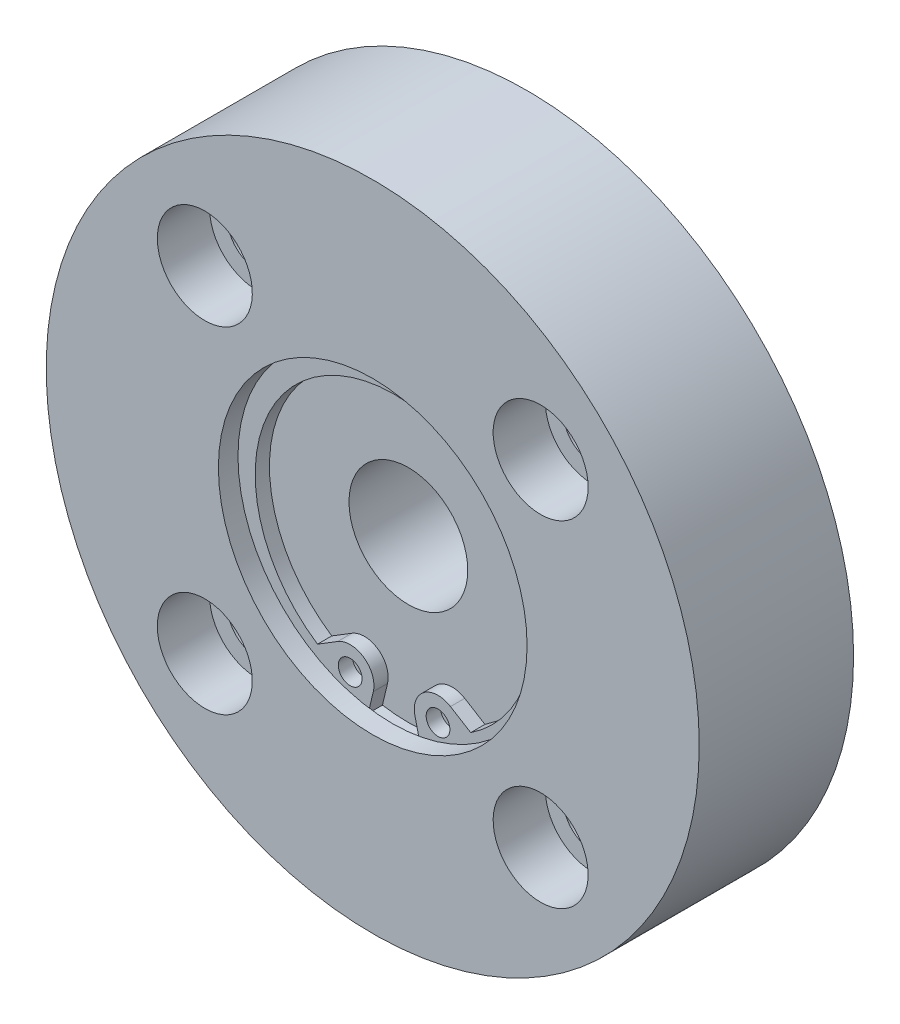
ISO-10303-21;
HEADER;
FILE_DESCRIPTION(('STEP AP214'),'2;1');
FILE_NAME('part.step','',(''),(''),'','','');
FILE_SCHEMA(('AUTOMOTIVE_DESIGN { 1 0 10303 214 1 1 1 1 }'));
ENDSEC;
DATA;
#1=APPLICATION_CONTEXT('core data for automotive mechanical design processes');
#2=APPLICATION_PROTOCOL_DEFINITION('international standard','automotive_design',2000,#1);
#3=PRODUCT_CONTEXT('',#1,'mechanical');
#4=PRODUCT('Part','Part','',(#3));
#5=PRODUCT_RELATED_PRODUCT_CATEGORY('part','',(#4));
#6=PRODUCT_DEFINITION_FORMATION('','',#4);
#7=PRODUCT_DEFINITION_CONTEXT('part definition',#1,'design');
#8=PRODUCT_DEFINITION('design','',#6,#7);
#9=PRODUCT_DEFINITION_SHAPE('','',#8);
#10=(LENGTH_UNIT() NAMED_UNIT(*) SI_UNIT(.MILLI.,.METRE.));
#11=(NAMED_UNIT(*) PLANE_ANGLE_UNIT() SI_UNIT($,.RADIAN.));
#12=(NAMED_UNIT(*) SI_UNIT($,.STERADIAN.) SOLID_ANGLE_UNIT());
#13=UNCERTAINTY_MEASURE_WITH_UNIT(LENGTH_MEASURE(1.E-05),#10,'distance_accuracy_value','');
#14=(GEOMETRIC_REPRESENTATION_CONTEXT(3) GLOBAL_UNCERTAINTY_ASSIGNED_CONTEXT((#13)) GLOBAL_UNIT_ASSIGNED_CONTEXT((#10,
#11,#12)) REPRESENTATION_CONTEXT('',''));
#15=CARTESIAN_POINT('',(0.,0.,0.));
#16=DIRECTION('',(0.,0.,1.));
#17=DIRECTION('',(1.,0.,0.));
#18=AXIS2_PLACEMENT_3D('',#15,#16,#17);
#19=CARTESIAN_POINT('',(0.,0.,10.));
#20=DIRECTION('',(0.,0.,1.));
#21=DIRECTION('',(1.,0.,0.));
#22=AXIS2_PLACEMENT_3D('',#19,#20,#21);
#23=PLANE('',#22);
#24=CARTESIAN_POINT('',(3.7,-11.165302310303,10.));
#25=DIRECTION('',(0.,0.,1.));
#26=DIRECTION('',(1.,0.,0.));
#27=AXIS2_PLACEMENT_3D('',#24,#25,#26);
#28=CIRCLE('',#27,1.);
#29=CARTESIAN_POINT('',(4.7,-11.165302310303,10.));
#30=VERTEX_POINT('',#29);
#31=EDGE_CURVE('E116',#30,#30,#28,.T.);
#32=ORIENTED_EDGE('',*,*,#31,.T.);
#33=EDGE_LOOP('',(#32));
#34=FACE_BOUND('',#33,.T.);
#35=ADVANCED_FACE('F14',(#34),#23,.T.);
#36=CARTESIAN_POINT('',(-3.7,-11.165302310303,10.));
#37=DIRECTION('',(0.,0.,-1.));
#38=DIRECTION('',(1.,0.,0.));
#39=AXIS2_PLACEMENT_3D('',#36,#37,#38);
#40=CIRCLE('',#39,1.);
#41=CARTESIAN_POINT('',(-2.7,-11.165302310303,10.));
#42=VERTEX_POINT('',#41);
#43=EDGE_CURVE('E141',#42,#42,#40,.T.);
#44=ORIENTED_EDGE('',*,*,#43,.F.);
#45=EDGE_LOOP('',(#44));
#46=FACE_BOUND('',#45,.T.);
#47=ADVANCED_FACE('F274',(#46),#23,.T.);
#48=CARTESIAN_POINT('',(14.1421356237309,14.142135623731,8.6));
#49=DIRECTION('',(0.,0.,1.));
#50=DIRECTION('',(1.,0.,0.));
#51=AXIS2_PLACEMENT_3D('',#48,#49,#50);
#52=PLANE('',#51);
#53=CARTESIAN_POINT('',(14.1421356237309,14.142135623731,8.6));
#54=DIRECTION('',(0.,0.,1.));
#55=DIRECTION('',(1.,0.,0.));
#56=AXIS2_PLACEMENT_3D('',#53,#54,#55);
#57=CIRCLE('',#56,4.);
#58=CARTESIAN_POINT('',(18.1421356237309,14.142135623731,8.6));
#59=VERTEX_POINT('',#58);
#60=EDGE_CURVE('E225',#59,#59,#57,.T.);
#61=ORIENTED_EDGE('',*,*,#60,.T.);
#62=EDGE_LOOP('',(#61));
#63=FACE_BOUND('',#62,.T.);
#64=CARTESIAN_POINT('',(14.1421356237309,14.142135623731,8.6));
#65=DIRECTION('',(0.,0.,1.));
#66=DIRECTION('',(1.,0.,0.));
#67=AXIS2_PLACEMENT_3D('',#64,#65,#66);
#68=CIRCLE('',#67,2.5);
#69=CARTESIAN_POINT('',(16.6421356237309,14.142135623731,8.6));
#70=VERTEX_POINT('',#69);
#71=EDGE_CURVE('E228',#70,#70,#68,.F.);
#72=ORIENTED_EDGE('',*,*,#71,.T.);
#73=EDGE_LOOP('',(#72));
#74=FACE_BOUND('',#73,.T.);
#75=ADVANCED_FACE('F280',(#63,#74),#52,.T.);
#76=CARTESIAN_POINT('',(14.142135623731,-14.1421356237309,8.6));
#77=DIRECTION('',(0.,0.,1.));
#78=DIRECTION('',(1.,0.,0.));
#79=AXIS2_PLACEMENT_3D('',#76,#77,#78);
#80=PLANE('',#79);
#81=CARTESIAN_POINT('',(14.142135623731,-14.1421356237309,8.6));
#82=DIRECTION('',(0.,0.,1.));
#83=DIRECTION('',(0.,-1.,0.));
#84=AXIS2_PLACEMENT_3D('',#81,#82,#83);
#85=CIRCLE('',#84,4.);
#86=CARTESIAN_POINT('',(14.142135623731,-18.1421356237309,8.6));
#87=VERTEX_POINT('',#86);
#88=EDGE_CURVE('E209',#87,#87,#85,.T.);
#89=ORIENTED_EDGE('',*,*,#88,.T.);
#90=EDGE_LOOP('',(#89));
#91=FACE_BOUND('',#90,.T.);
#92=CARTESIAN_POINT('',(14.142135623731,-14.1421356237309,8.6));
#93=DIRECTION('',(0.,0.,1.));
#94=DIRECTION('',(1.,0.,0.));
#95=AXIS2_PLACEMENT_3D('',#92,#93,#94);
#96=CIRCLE('',#95,2.5);
#97=CARTESIAN_POINT('',(16.642135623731,-14.1421356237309,8.6));
#98=VERTEX_POINT('',#97);
#99=EDGE_CURVE('E212',#98,#98,#96,.F.);
#100=ORIENTED_EDGE('',*,*,#99,.T.);
#101=EDGE_LOOP('',(#100));
#102=FACE_BOUND('',#101,.T.);
#103=ADVANCED_FACE('F556',(#91,#102),#80,.T.);
#104=CARTESIAN_POINT('',(-14.142135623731,-14.1421356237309,8.6));
#105=DIRECTION('',(0.,0.,1.));
#106=DIRECTION('',(1.,0.,0.));
#107=AXIS2_PLACEMENT_3D('',#104,#105,#106);
#108=PLANE('',#107);
#109=CARTESIAN_POINT('',(-14.142135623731,-14.1421356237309,8.6));
#110=DIRECTION('',(0.,0.,1.));
#111=DIRECTION('',(-1.,0.,0.));
#112=AXIS2_PLACEMENT_3D('',#109,#110,#111);
#113=CIRCLE('',#112,4.);
#114=CARTESIAN_POINT('',(-18.142135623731,-14.1421356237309,8.6));
#115=VERTEX_POINT('',#114);
#116=EDGE_CURVE('E202',#115,#115,#113,.T.);
#117=ORIENTED_EDGE('',*,*,#116,.T.);
#118=EDGE_LOOP('',(#117));
#119=FACE_BOUND('',#118,.T.);
#120=CARTESIAN_POINT('',(-14.142135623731,-14.1421356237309,8.6));
#121=DIRECTION('',(0.,0.,1.));
#122=DIRECTION('',(1.,0.,0.));
#123=AXIS2_PLACEMENT_3D('',#120,#121,#122);
#124=CIRCLE('',#123,2.5);
#125=CARTESIAN_POINT('',(-11.642135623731,-14.1421356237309,8.6));
#126=VERTEX_POINT('',#125);
#127=EDGE_CURVE('E205',#126,#126,#124,.F.);
#128=ORIENTED_EDGE('',*,*,#127,.T.);
#129=EDGE_LOOP('',(#128));
#130=FACE_BOUND('',#129,.T.);
#131=ADVANCED_FACE('F547',(#119,#130),#108,.T.);
#132=CARTESIAN_POINT('',(-14.1421356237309,14.142135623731,8.6));
#133=DIRECTION('',(0.,0.,1.));
#134=DIRECTION('',(1.,0.,0.));
#135=AXIS2_PLACEMENT_3D('',#132,#133,#134);
#136=PLANE('',#135);
#137=CARTESIAN_POINT('',(-14.1421356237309,14.142135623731,8.6));
#138=DIRECTION('',(0.,0.,1.));
#139=DIRECTION('',(0.,1.,0.));
#140=AXIS2_PLACEMENT_3D('',#137,#138,#139);
#141=CIRCLE('',#140,4.);
#142=CARTESIAN_POINT('',(-14.1421356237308,18.142135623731,8.6));
#143=VERTEX_POINT('',#142);
#144=EDGE_CURVE('E195',#143,#143,#141,.T.);
#145=ORIENTED_EDGE('',*,*,#144,.T.);
#146=EDGE_LOOP('',(#145));
#147=FACE_BOUND('',#146,.T.);
#148=CARTESIAN_POINT('',(-14.1421356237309,14.142135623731,8.6));
#149=DIRECTION('',(0.,0.,1.));
#150=DIRECTION('',(1.,0.,0.));
#151=AXIS2_PLACEMENT_3D('',#148,#149,#150);
#152=CIRCLE('',#151,2.5);
#153=CARTESIAN_POINT('',(-11.6421356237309,14.142135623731,8.6));
#154=VERTEX_POINT('',#153);
#155=EDGE_CURVE('E198',#154,#154,#152,.F.);
#156=ORIENTED_EDGE('',*,*,#155,.T.);
#157=EDGE_LOOP('',(#156));
#158=FACE_BOUND('',#157,.T.);
#159=ADVANCED_FACE('F538',(#147,#158),#136,.T.);
#160=CARTESIAN_POINT('',(14.1421356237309,14.142135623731,0.));
#161=DIRECTION('',(0.,0.,1.));
#162=DIRECTION('',(1.,0.,0.));
#163=AXIS2_PLACEMENT_3D('',#160,#161,#162);
#164=CYLINDRICAL_SURFACE('',#163,2.5);
#165=CARTESIAN_POINT('',(14.1421356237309,14.142135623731,0.));
#166=DIRECTION('',(0.,0.,1.));
#167=DIRECTION('',(1.,0.,0.));
#168=AXIS2_PLACEMENT_3D('',#165,#166,#167);
#169=CIRCLE('',#168,2.5);
#170=CARTESIAN_POINT('',(16.6421356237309,14.142135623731,0.));
#171=VERTEX_POINT('',#170);
#172=EDGE_CURVE('E229',#171,#171,#169,.T.);
#173=ORIENTED_EDGE('',*,*,#172,.F.);
#174=EDGE_LOOP('',(#173));
#175=FACE_BOUND('',#174,.T.);
#176=ORIENTED_EDGE('',*,*,#71,.F.);
#177=EDGE_LOOP('',(#176));
#178=FACE_BOUND('',#177,.T.);
#179=ADVANCED_FACE('F529',(#175,#178),#164,.F.);
#180=CARTESIAN_POINT('',(14.142135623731,-14.1421356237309,0.));
#181=DIRECTION('',(0.,0.,1.));
#182=DIRECTION('',(1.,0.,0.));
#183=AXIS2_PLACEMENT_3D('',#180,#181,#182);
#184=CYLINDRICAL_SURFACE('',#183,2.5);
#185=CARTESIAN_POINT('',(14.142135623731,-14.1421356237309,0.));
#186=DIRECTION('',(0.,0.,1.));
#187=DIRECTION('',(0.,-1.,0.));
#188=AXIS2_PLACEMENT_3D('',#185,#186,#187);
#189=CIRCLE('',#188,2.5);
#190=CARTESIAN_POINT('',(14.142135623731,-16.6421356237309,0.));
#191=VERTEX_POINT('',#190);
#192=EDGE_CURVE('E219',#191,#191,#189,.T.);
#193=ORIENTED_EDGE('',*,*,#192,.F.);
#194=EDGE_LOOP('',(#193));
#195=FACE_BOUND('',#194,.T.);
#196=ORIENTED_EDGE('',*,*,#99,.F.);
#197=EDGE_LOOP('',(#196));
#198=FACE_BOUND('',#197,.T.);
#199=ADVANCED_FACE('F520',(#195,#198),#184,.F.);
#200=CARTESIAN_POINT('',(-14.142135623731,-14.1421356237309,0.));
#201=DIRECTION('',(0.,0.,1.));
#202=DIRECTION('',(1.,0.,0.));
#203=AXIS2_PLACEMENT_3D('',#200,#201,#202);
#204=CYLINDRICAL_SURFACE('',#203,2.5);
#205=CARTESIAN_POINT('',(-14.142135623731,-14.1421356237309,0.));
#206=DIRECTION('',(0.,0.,1.));
#207=DIRECTION('',(-1.,0.,0.));
#208=AXIS2_PLACEMENT_3D('',#205,#206,#207);
#209=CIRCLE('',#208,2.5);
#210=CARTESIAN_POINT('',(-16.642135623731,-14.1421356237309,0.));
#211=VERTEX_POINT('',#210);
#212=EDGE_CURVE('E216',#211,#211,#209,.T.);
#213=ORIENTED_EDGE('',*,*,#212,.F.);
#214=EDGE_LOOP('',(#213));
#215=FACE_BOUND('',#214,.T.);
#216=ORIENTED_EDGE('',*,*,#127,.F.);
#217=EDGE_LOOP('',(#216));
#218=FACE_BOUND('',#217,.T.);
#219=ADVANCED_FACE('F511',(#215,#218),#204,.F.);
#220=CARTESIAN_POINT('',(-14.1421356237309,14.142135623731,0.));
#221=DIRECTION('',(0.,0.,1.));
#222=DIRECTION('',(1.,0.,0.));
#223=AXIS2_PLACEMENT_3D('',#220,#221,#222);
#224=CYLINDRICAL_SURFACE('',#223,2.5);
#225=CARTESIAN_POINT('',(-14.1421356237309,14.142135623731,0.));
#226=DIRECTION('',(0.,0.,1.));
#227=DIRECTION('',(0.,1.,0.));
#228=AXIS2_PLACEMENT_3D('',#225,#226,#227);
#229=CIRCLE('',#228,2.5);
#230=CARTESIAN_POINT('',(-14.1421356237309,16.642135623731,0.));
#231=VERTEX_POINT('',#230);
#232=EDGE_CURVE('E213',#231,#231,#229,.T.);
#233=ORIENTED_EDGE('',*,*,#232,.F.);
#234=EDGE_LOOP('',(#233));
#235=FACE_BOUND('',#234,.T.);
#236=ORIENTED_EDGE('',*,*,#155,.F.);
#237=EDGE_LOOP('',(#236));
#238=FACE_BOUND('',#237,.T.);
#239=ADVANCED_FACE('F503',(#235,#238),#224,.F.);
#240=CARTESIAN_POINT('',(0.,0.,13.));
#241=DIRECTION('',(0.,0.,-1.));
#242=DIRECTION('',(-1.,0.,0.));
#243=AXIS2_PLACEMENT_3D('',#240,#241,#242);
#244=CYLINDRICAL_SURFACE('',#243,27.5);
#245=CARTESIAN_POINT('',(0.,0.,13.));
#246=DIRECTION('',(0.,0.,1.));
#247=DIRECTION('',(1.,0.,0.));
#248=AXIS2_PLACEMENT_3D('',#245,#246,#247);
#249=CIRCLE('',#248,27.5);
#250=CARTESIAN_POINT('',(27.5,0.,13.));
#251=VERTEX_POINT('',#250);
#252=EDGE_CURVE('E142',#251,#251,#249,.T.);
#253=ORIENTED_EDGE('',*,*,#252,.F.);
#254=EDGE_LOOP('',(#253));
#255=FACE_BOUND('',#254,.T.);
#256=CARTESIAN_POINT('',(0.,0.,0.));
#257=DIRECTION('',(0.,0.,1.));
#258=DIRECTION('',(1.,0.,0.));
#259=AXIS2_PLACEMENT_3D('',#256,#257,#258);
#260=CIRCLE('',#259,27.5);
#261=CARTESIAN_POINT('',(27.5,0.,0.));
#262=VERTEX_POINT('',#261);
#263=EDGE_CURVE('E232',#262,#262,#260,.T.);
#264=ORIENTED_EDGE('',*,*,#263,.T.);
#265=EDGE_LOOP('',(#264));
#266=FACE_BOUND('',#265,.T.);
#267=ADVANCED_FACE('F16',(#255,#266),#244,.T.);
#268=CARTESIAN_POINT('',(14.1421356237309,14.142135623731,8.6));
#269=DIRECTION('',(0.,0.,1.));
#270=DIRECTION('',(1.,0.,0.));
#271=AXIS2_PLACEMENT_3D('',#268,#269,#270);
#272=CYLINDRICAL_SURFACE('',#271,4.);
#273=ORIENTED_EDGE('',*,*,#60,.F.);
#274=EDGE_LOOP('',(#273));
#275=FACE_BOUND('',#274,.T.);
#276=CARTESIAN_POINT('',(14.1421356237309,14.142135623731,13.));
#277=DIRECTION('',(0.,0.,1.));
#278=DIRECTION('',(1.,0.,0.));
#279=AXIS2_PLACEMENT_3D('',#276,#277,#278);
#280=CIRCLE('',#279,4.);
#281=CARTESIAN_POINT('',(18.1421356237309,14.142135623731,13.));
#282=VERTEX_POINT('',#281);
#283=EDGE_CURVE('E222',#282,#282,#280,.T.);
#284=ORIENTED_EDGE('',*,*,#283,.T.);
#285=EDGE_LOOP('',(#284));
#286=FACE_BOUND('',#285,.T.);
#287=ADVANCED_FACE('F486',(#275,#286),#272,.F.);
#288=CARTESIAN_POINT('',(14.142135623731,-14.1421356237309,8.6));
#289=DIRECTION('',(0.,0.,1.));
#290=DIRECTION('',(1.,0.,0.));
#291=AXIS2_PLACEMENT_3D('',#288,#289,#290);
#292=CYLINDRICAL_SURFACE('',#291,4.);
#293=ORIENTED_EDGE('',*,*,#88,.F.);
#294=EDGE_LOOP('',(#293));
#295=FACE_BOUND('',#294,.T.);
#296=CARTESIAN_POINT('',(14.142135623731,-14.1421356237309,13.));
#297=DIRECTION('',(0.,0.,1.));
#298=DIRECTION('',(0.,-1.,0.));
#299=AXIS2_PLACEMENT_3D('',#296,#297,#298);
#300=CIRCLE('',#299,4.);
#301=CARTESIAN_POINT('',(14.142135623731,-18.1421356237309,13.));
#302=VERTEX_POINT('',#301);
#303=EDGE_CURVE('E206',#302,#302,#300,.T.);
#304=ORIENTED_EDGE('',*,*,#303,.T.);
#305=EDGE_LOOP('',(#304));
#306=FACE_BOUND('',#305,.T.);
#307=ADVANCED_FACE('F477',(#295,#306),#292,.F.);
#308=CARTESIAN_POINT('',(-14.142135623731,-14.1421356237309,8.6));
#309=DIRECTION('',(0.,0.,1.));
#310=DIRECTION('',(1.,0.,0.));
#311=AXIS2_PLACEMENT_3D('',#308,#309,#310);
#312=CYLINDRICAL_SURFACE('',#311,4.);
#313=ORIENTED_EDGE('',*,*,#116,.F.);
#314=EDGE_LOOP('',(#313));
#315=FACE_BOUND('',#314,.T.);
#316=CARTESIAN_POINT('',(-14.142135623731,-14.1421356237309,13.));
#317=DIRECTION('',(0.,0.,1.));
#318=DIRECTION('',(-1.,0.,0.));
#319=AXIS2_PLACEMENT_3D('',#316,#317,#318);
#320=CIRCLE('',#319,4.);
#321=CARTESIAN_POINT('',(-18.142135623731,-14.1421356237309,13.));
#322=VERTEX_POINT('',#321);
#323=EDGE_CURVE('E199',#322,#322,#320,.T.);
#324=ORIENTED_EDGE('',*,*,#323,.T.);
#325=EDGE_LOOP('',(#324));
#326=FACE_BOUND('',#325,.T.);
#327=ADVANCED_FACE('F468',(#315,#326),#312,.F.);
#328=CARTESIAN_POINT('',(-14.1421356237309,14.142135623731,8.6));
#329=DIRECTION('',(0.,0.,1.));
#330=DIRECTION('',(1.,0.,0.));
#331=AXIS2_PLACEMENT_3D('',#328,#329,#330);
#332=CYLINDRICAL_SURFACE('',#331,4.);
#333=ORIENTED_EDGE('',*,*,#144,.F.);
#334=EDGE_LOOP('',(#333));
#335=FACE_BOUND('',#334,.T.);
#336=CARTESIAN_POINT('',(-14.1421356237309,14.142135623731,13.));
#337=DIRECTION('',(0.,0.,1.));
#338=DIRECTION('',(0.,1.,0.));
#339=AXIS2_PLACEMENT_3D('',#336,#337,#338);
#340=CIRCLE('',#339,4.);
#341=CARTESIAN_POINT('',(-14.1421356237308,18.142135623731,13.));
#342=VERTEX_POINT('',#341);
#343=EDGE_CURVE('E192',#342,#342,#340,.T.);
#344=ORIENTED_EDGE('',*,*,#343,.T.);
#345=EDGE_LOOP('',(#344));
#346=FACE_BOUND('',#345,.T.);
#347=ADVANCED_FACE('F459',(#335,#346),#332,.F.);
#348=CARTESIAN_POINT('',(0.,0.,0.));
#349=DIRECTION('',(0.,0.,1.));
#350=DIRECTION('',(1.,0.,0.));
#351=AXIS2_PLACEMENT_3D('',#348,#349,#350);
#352=PLANE('',#351);
#353=CARTESIAN_POINT('',(0.,0.,0.));
#354=DIRECTION('',(0.,0.,-1.));
#355=DIRECTION('',(-1.,0.,0.));
#356=AXIS2_PLACEMENT_3D('',#353,#354,#355);
#357=CIRCLE('',#356,11.);
#358=CARTESIAN_POINT('',(-11.,0.,0.));
#359=VERTEX_POINT('',#358);
#360=EDGE_CURVE('E181',#359,#359,#357,.T.);
#361=ORIENTED_EDGE('',*,*,#360,.F.);
#362=EDGE_LOOP('',(#361));
#363=FACE_BOUND('',#362,.T.);
#364=ORIENTED_EDGE('',*,*,#232,.T.);
#365=EDGE_LOOP('',(#364));
#366=FACE_BOUND('',#365,.T.);
#367=ORIENTED_EDGE('',*,*,#212,.T.);
#368=EDGE_LOOP('',(#367));
#369=FACE_BOUND('',#368,.T.);
#370=ORIENTED_EDGE('',*,*,#192,.T.);
#371=EDGE_LOOP('',(#370));
#372=FACE_BOUND('',#371,.T.);
#373=ORIENTED_EDGE('',*,*,#172,.T.);
#374=EDGE_LOOP('',(#373));
#375=FACE_BOUND('',#374,.T.);
#376=ORIENTED_EDGE('',*,*,#263,.F.);
#377=EDGE_LOOP('',(#376));
#378=FACE_BOUND('',#377,.T.);
#379=ADVANCED_FACE('F451',(#363,#366,#369,#372,#375,#378),#352,.F.);
#380=CARTESIAN_POINT('',(0.,0.,13.));
#381=DIRECTION('',(0.,0.,1.));
#382=DIRECTION('',(1.,0.,0.));
#383=AXIS2_PLACEMENT_3D('',#380,#381,#382);
#384=PLANE('',#383);
#385=CARTESIAN_POINT('',(0.,0.,13.));
#386=DIRECTION('',(0.,0.,1.));
#387=DIRECTION('',(1.,0.,0.));
#388=AXIS2_PLACEMENT_3D('',#385,#386,#387);
#389=CIRCLE('',#388,13.);
#390=CARTESIAN_POINT('',(13.,0.,13.));
#391=VERTEX_POINT('',#390);
#392=EDGE_CURVE('E188',#391,#391,#389,.T.);
#393=ORIENTED_EDGE('',*,*,#392,.F.);
#394=EDGE_LOOP('',(#393));
#395=FACE_BOUND('',#394,.T.);
#396=ORIENTED_EDGE('',*,*,#343,.F.);
#397=EDGE_LOOP('',(#396));
#398=FACE_BOUND('',#397,.T.);
#399=ORIENTED_EDGE('',*,*,#323,.F.);
#400=EDGE_LOOP('',(#399));
#401=FACE_BOUND('',#400,.T.);
#402=ORIENTED_EDGE('',*,*,#303,.F.);
#403=EDGE_LOOP('',(#402));
#404=FACE_BOUND('',#403,.T.);
#405=ORIENTED_EDGE('',*,*,#283,.F.);
#406=EDGE_LOOP('',(#405));
#407=FACE_BOUND('',#406,.T.);
#408=ORIENTED_EDGE('',*,*,#252,.T.);
#409=EDGE_LOOP('',(#408));
#410=FACE_BOUND('',#409,.T.);
#411=ADVANCED_FACE('F443',(#395,#398,#401,#404,#407,#410),#384,.T.);
#412=CARTESIAN_POINT('',(0.,0.,2.));
#413=DIRECTION('',(0.,0.,-1.));
#414=DIRECTION('',(-1.,0.,0.));
#415=AXIS2_PLACEMENT_3D('',#412,#413,#414);
#416=CYLINDRICAL_SURFACE('',#415,11.);
#417=CARTESIAN_POINT('',(0.,0.,2.));
#418=DIRECTION('',(0.,0.,-1.));
#419=DIRECTION('',(-1.,0.,0.));
#420=AXIS2_PLACEMENT_3D('',#417,#418,#419);
#421=CIRCLE('',#420,11.);
#422=CARTESIAN_POINT('',(-11.,0.,2.));
#423=VERTEX_POINT('',#422);
#424=EDGE_CURVE('E184',#423,#423,#421,.T.);
#425=ORIENTED_EDGE('',*,*,#424,.F.);
#426=EDGE_LOOP('',(#425));
#427=FACE_BOUND('',#426,.T.);
#428=ORIENTED_EDGE('',*,*,#360,.T.);
#429=EDGE_LOOP('',(#428));
#430=FACE_BOUND('',#429,.T.);
#431=ADVANCED_FACE('F435',(#427,#430),#416,.F.);
#432=CARTESIAN_POINT('',(0.,0.,10.));
#433=DIRECTION('',(0.,0.,1.));
#434=DIRECTION('',(1.,0.,0.));
#435=AXIS2_PLACEMENT_3D('',#432,#433,#434);
#436=CYLINDRICAL_SURFACE('',#435,13.);
#437=CARTESIAN_POINT('',(0.,0.,11.35));
#438=DIRECTION('',(0.,0.,1.));
#439=DIRECTION('',(1.,0.,0.));
#440=AXIS2_PLACEMENT_3D('',#437,#438,#439);
#441=CIRCLE('',#440,13.);
#442=CARTESIAN_POINT('',(13.,0.,11.35));
#443=VERTEX_POINT('',#442);
#444=EDGE_CURVE('E177',#443,#443,#441,.F.);
#445=ORIENTED_EDGE('',*,*,#444,.T.);
#446=EDGE_LOOP('',(#445));
#447=FACE_BOUND('',#446,.T.);
#448=ORIENTED_EDGE('',*,*,#392,.T.);
#449=EDGE_LOOP('',(#448));
#450=FACE_BOUND('',#449,.T.);
#451=ADVANCED_FACE('F252',(#447,#450),#436,.F.);
#452=CARTESIAN_POINT('',(0.,0.,2.));
#453=DIRECTION('',(0.,0.,-1.));
#454=DIRECTION('',(-1.,0.,0.));
#455=AXIS2_PLACEMENT_3D('',#452,#453,#454);
#456=PLANE('',#455);
#457=CARTESIAN_POINT('',(0.,0.,2.));
#458=DIRECTION('',(0.,0.,-1.));
#459=DIRECTION('',(-1.,0.,0.));
#460=AXIS2_PLACEMENT_3D('',#457,#458,#459);
#461=CIRCLE('',#460,5.);
#462=CARTESIAN_POINT('',(-5.,0.,2.));
#463=VERTEX_POINT('',#462);
#464=EDGE_CURVE('E187',#463,#463,#461,.T.);
#465=ORIENTED_EDGE('',*,*,#464,.F.);
#466=EDGE_LOOP('',(#465));
#467=FACE_BOUND('',#466,.T.);
#468=ORIENTED_EDGE('',*,*,#424,.T.);
#469=EDGE_LOOP('',(#468));
#470=FACE_BOUND('',#469,.T.);
#471=ADVANCED_FACE('F258',(#467,#470),#456,.T.);
#472=CARTESIAN_POINT('',(0.,0.,11.35));
#473=DIRECTION('',(0.,0.,1.));
#474=DIRECTION('',(1.,0.,0.));
#475=AXIS2_PLACEMENT_3D('',#472,#473,#474);
#476=PLANE('',#475);
#477=CARTESIAN_POINT('',(0.,0.,11.35));
#478=DIRECTION('',(0.,0.,1.));
#479=DIRECTION('',(1.,0.,0.));
#480=AXIS2_PLACEMENT_3D('',#477,#478,#479);
#481=CIRCLE('',#480,13.6);
#482=CARTESIAN_POINT('',(13.6,0.,11.35));
#483=VERTEX_POINT('',#482);
#484=EDGE_CURVE('E174',#483,#483,#481,.T.);
#485=ORIENTED_EDGE('',*,*,#484,.F.);
#486=EDGE_LOOP('',(#485));
#487=FACE_BOUND('',#486,.T.);
#488=ORIENTED_EDGE('',*,*,#444,.F.);
#489=EDGE_LOOP('',(#488));
#490=FACE_BOUND('',#489,.T.);
#491=ADVANCED_FACE('F255',(#487,#490),#476,.F.);
#492=CARTESIAN_POINT('',(0.,0.,11.35));
#493=DIRECTION('',(0.,0.,-1.));
#494=DIRECTION('',(-1.,0.,0.));
#495=AXIS2_PLACEMENT_3D('',#492,#493,#494);
#496=CYLINDRICAL_SURFACE('',#495,13.6);
#497=ORIENTED_EDGE('',*,*,#484,.T.);
#498=EDGE_LOOP('',(#497));
#499=FACE_BOUND('',#498,.T.);
#500=DIRECTION('',(0.,0.,-1.));
#501=VECTOR('',#500,1.);
#502=CARTESIAN_POINT('',(2.18133072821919,-13.4239262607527,11.35));
#503=LINE('',#502,#501);
#504=CARTESIAN_POINT('',(2.18133072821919,-13.4239262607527,10.));
#505=VERTEX_POINT('',#504);
#506=CARTESIAN_POINT('',(2.18133072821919,-13.4239262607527,11.2));
#507=VERTEX_POINT('',#506);
#508=EDGE_CURVE('E18',#505,#507,#503,.F.);
#509=ORIENTED_EDGE('',*,*,#508,.F.);
#510=CARTESIAN_POINT('',(0.,0.,10.));
#511=DIRECTION('',(0.,0.,1.));
#512=DIRECTION('',(1.,0.,0.));
#513=AXIS2_PLACEMENT_3D('',#510,#511,#512);
#514=CIRCLE('',#513,13.6);
#515=CARTESIAN_POINT('',(-2.18133072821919,-13.4239262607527,10.));
#516=VERTEX_POINT('',#515);
#517=EDGE_CURVE('E178',#516,#505,#514,.T.);
#518=ORIENTED_EDGE('',*,*,#517,.F.);
#519=DIRECTION('',(0.,0.,-1.));
#520=VECTOR('',#519,1.);
#521=CARTESIAN_POINT('',(-2.18133072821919,-13.4239262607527,11.35));
#522=LINE('',#521,#520);
#523=CARTESIAN_POINT('',(-2.18133072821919,-13.4239262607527,11.2));
#524=VERTEX_POINT('',#523);
#525=EDGE_CURVE('E105',#524,#516,#522,.T.);
#526=ORIENTED_EDGE('',*,*,#525,.F.);
#527=CARTESIAN_POINT('',(0.,0.,11.2));
#528=DIRECTION('',(0.,0.,-1.));
#529=DIRECTION('',(-1.,0.,0.));
#530=AXIS2_PLACEMENT_3D('',#527,#528,#529);
#531=CIRCLE('',#530,13.6);
#532=EDGE_CURVE('E9',#507,#524,#531,.F.);
#533=ORIENTED_EDGE('',*,*,#532,.F.);
#534=EDGE_LOOP('',(#509,#518,#526,#533));
#535=FACE_BOUND('',#534,.T.);
#536=ADVANCED_FACE('F257',(#499,#535),#496,.F.);
#537=CARTESIAN_POINT('',(0.,0.,13.));
#538=DIRECTION('',(0.,0.,-1.));
#539=DIRECTION('',(-1.,0.,0.));
#540=AXIS2_PLACEMENT_3D('',#537,#538,#539);
#541=CYLINDRICAL_SURFACE('',#540,5.);
#542=CARTESIAN_POINT('',(0.,0.,10.));
#543=DIRECTION('',(0.,0.,1.));
#544=DIRECTION('',(1.,0.,0.));
#545=AXIS2_PLACEMENT_3D('',#542,#543,#544);
#546=CIRCLE('',#545,5.);
#547=CARTESIAN_POINT('',(5.,0.,10.));
#548=VERTEX_POINT('',#547);
#549=EDGE_CURVE('E191',#548,#548,#546,.T.);
#550=ORIENTED_EDGE('',*,*,#549,.T.);
#551=EDGE_LOOP('',(#550));
#552=FACE_BOUND('',#551,.T.);
#553=ORIENTED_EDGE('',*,*,#464,.T.);
#554=EDGE_LOOP('',(#553));
#555=FACE_BOUND('',#554,.T.);
#556=ADVANCED_FACE('F266',(#552,#555),#541,.F.);
#557=ORIENTED_EDGE('',*,*,#549,.F.);
#558=EDGE_LOOP('',(#557));
#559=FACE_BOUND('',#558,.T.);
#560=DIRECTION('',(0.231349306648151,-0.972870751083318,0.));
#561=VECTOR('',#560,1.);
#562=CARTESIAN_POINT('',(1.75425849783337,-11.6280009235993,10.));
#563=LINE('',#562,#561);
#564=CARTESIAN_POINT('',(1.75425849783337,-11.6280009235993,10.));
#565=VERTEX_POINT('',#564);
#566=EDGE_CURVE('E34',#565,#505,#563,.T.);
#567=ORIENTED_EDGE('',*,*,#566,.F.);
#568=CARTESIAN_POINT('',(3.7,-11.165302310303,10.));
#569=DIRECTION('',(0.,0.,1.));
#570=DIRECTION('',(1.,0.,0.));
#571=AXIS2_PLACEMENT_3D('',#568,#569,#570);
#572=CIRCLE('',#571,2.);
#573=CARTESIAN_POINT('',(4.74866968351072,-9.46227797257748,10.));
#574=VERTEX_POINT('',#573);
#575=EDGE_CURVE('E136',#574,#565,#572,.T.);
#576=ORIENTED_EDGE('',*,*,#575,.F.);
#577=DIRECTION('',(-0.851512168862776,0.524334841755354,0.));
#578=VECTOR('',#577,1.);
#579=CARTESIAN_POINT('',(4.74866968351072,-9.46227797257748,10.));
#580=LINE('',#579,#578);
#581=CARTESIAN_POINT('',(6.45127454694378,-10.5106893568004,10.));
#582=VERTEX_POINT('',#581);
#583=EDGE_CURVE('E111',#582,#574,#580,.T.);
#584=ORIENTED_EDGE('',*,*,#583,.F.);
#585=CARTESIAN_POINT('',(0.,-0.75,10.));
#586=DIRECTION('',(0.,0.,-1.));
#587=DIRECTION('',(0.,-1.,0.));
#588=AXIS2_PLACEMENT_3D('',#585,#586,#587);
#589=CIRCLE('',#588,11.7);
#590=CARTESIAN_POINT('',(-6.45127454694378,-10.5106893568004,10.));
#591=VERTEX_POINT('',#590);
#592=EDGE_CURVE('E108',#591,#582,#589,.T.);
#593=ORIENTED_EDGE('',*,*,#592,.F.);
#594=DIRECTION('',(-0.851512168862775,-0.524334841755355,0.));
#595=VECTOR('',#594,1.);
#596=CARTESIAN_POINT('',(-4.74866968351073,-9.46227797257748,10.));
#597=LINE('',#596,#595);
#598=CARTESIAN_POINT('',(-4.74866968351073,-9.46227797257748,10.));
#599=VERTEX_POINT('',#598);
#600=EDGE_CURVE('E94',#599,#591,#597,.T.);
#601=ORIENTED_EDGE('',*,*,#600,.F.);
#602=CARTESIAN_POINT('',(-3.7,-11.165302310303,10.));
#603=DIRECTION('',(0.,0.,1.));
#604=DIRECTION('',(-1.,0.,0.));
#605=AXIS2_PLACEMENT_3D('',#602,#603,#604);
#606=CIRCLE('',#605,2.);
#607=CARTESIAN_POINT('',(-1.75425849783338,-11.6280009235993,10.));
#608=VERTEX_POINT('',#607);
#609=EDGE_CURVE('E147',#608,#599,#606,.T.);
#610=ORIENTED_EDGE('',*,*,#609,.F.);
#611=DIRECTION('',(0.231349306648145,0.97287075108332,0.));
#612=VECTOR('',#611,1.);
#613=CARTESIAN_POINT('',(-1.75425849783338,-11.6280009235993,10.));
#614=LINE('',#613,#612);
#615=EDGE_CURVE('E143',#516,#608,#614,.T.);
#616=ORIENTED_EDGE('',*,*,#615,.F.);
#617=ORIENTED_EDGE('',*,*,#517,.T.);
#618=EDGE_LOOP('',(#567,#576,#584,#593,#601,#610,#616,#617));
#619=FACE_BOUND('',#618,.T.);
#620=ADVANCED_FACE('F109',(#559,#619),#23,.T.);
#621=CARTESIAN_POINT('',(0.,-0.75,11.2));
#622=DIRECTION('',(0.,0.,1.));
#623=DIRECTION('',(-1.,0.,0.));
#624=AXIS2_PLACEMENT_3D('',#621,#622,#623);
#625=CYLINDRICAL_SURFACE('',#624,11.7);
#626=ORIENTED_EDGE('',*,*,#592,.T.);
#627=DIRECTION('',(0.,0.,-1.));
#628=VECTOR('',#627,1.);
#629=CARTESIAN_POINT('',(6.45127454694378,-10.5106893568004,11.2));
#630=LINE('',#629,#628);
#631=CARTESIAN_POINT('',(6.45127454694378,-10.5106893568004,11.2));
#632=VERTEX_POINT('',#631);
#633=EDGE_CURVE('E126',#632,#582,#630,.T.);
#634=ORIENTED_EDGE('',*,*,#633,.F.);
#635=CARTESIAN_POINT('',(0.,-0.75,11.2));
#636=DIRECTION('',(0.,0.,-1.));
#637=DIRECTION('',(0.,-1.,0.));
#638=AXIS2_PLACEMENT_3D('',#635,#636,#637);
#639=CIRCLE('',#638,11.7);
#640=CARTESIAN_POINT('',(-6.45127454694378,-10.5106893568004,11.2));
#641=VERTEX_POINT('',#640);
#642=EDGE_CURVE('E119',#641,#632,#639,.T.);
#643=ORIENTED_EDGE('',*,*,#642,.F.);
#644=DIRECTION('',(0.,0.,-1.));
#645=VECTOR('',#644,1.);
#646=CARTESIAN_POINT('',(-6.45127454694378,-10.5106893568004,11.2));
#647=LINE('',#646,#645);
#648=EDGE_CURVE('E98',#641,#591,#647,.T.);
#649=ORIENTED_EDGE('',*,*,#648,.T.);
#650=EDGE_LOOP('',(#626,#634,#643,#649));
#651=FACE_BOUND('',#650,.T.);
#652=ADVANCED_FACE('F118',(#651),#625,.F.);
#653=CARTESIAN_POINT('',(4.74866968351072,-9.46227797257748,11.2));
#654=DIRECTION('',(-0.524334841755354,-0.851512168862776,0.));
#655=DIRECTION('',(-0.851512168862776,0.524334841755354,0.));
#656=AXIS2_PLACEMENT_3D('',#653,#654,#655);
#657=PLANE('',#656);
#658=ORIENTED_EDGE('',*,*,#583,.T.);
#659=DIRECTION('',(0.,0.,-1.));
#660=VECTOR('',#659,1.);
#661=CARTESIAN_POINT('',(4.74866968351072,-9.46227797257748,11.2));
#662=LINE('',#661,#660);
#663=CARTESIAN_POINT('',(4.74866968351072,-9.46227797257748,11.2));
#664=VERTEX_POINT('',#663);
#665=EDGE_CURVE('E154',#664,#574,#662,.T.);
#666=ORIENTED_EDGE('',*,*,#665,.F.);
#667=DIRECTION('',(-0.851512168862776,0.524334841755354,0.));
#668=VECTOR('',#667,1.);
#669=CARTESIAN_POINT('',(4.74866968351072,-9.46227797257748,11.2));
#670=LINE('',#669,#668);
#671=EDGE_CURVE('E130',#632,#664,#670,.T.);
#672=ORIENTED_EDGE('',*,*,#671,.F.);
#673=ORIENTED_EDGE('',*,*,#633,.T.);
#674=EDGE_LOOP('',(#658,#666,#672,#673));
#675=FACE_BOUND('',#674,.T.);
#676=ADVANCED_FACE('F288',(#675),#657,.F.);
#677=CARTESIAN_POINT('',(3.7,-11.165302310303,11.2));
#678=DIRECTION('',(0.,0.,1.));
#679=DIRECTION('',(-1.,0.,0.));
#680=AXIS2_PLACEMENT_3D('',#677,#678,#679);
#681=CYLINDRICAL_SURFACE('',#680,2.);
#682=ORIENTED_EDGE('',*,*,#575,.T.);
#683=DIRECTION('',(0.,0.,-1.));
#684=VECTOR('',#683,1.);
#685=CARTESIAN_POINT('',(1.75425849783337,-11.6280009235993,11.2));
#686=LINE('',#685,#684);
#687=CARTESIAN_POINT('',(1.75425849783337,-11.6280009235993,11.2));
#688=VERTEX_POINT('',#687);
#689=EDGE_CURVE('E146',#688,#565,#686,.T.);
#690=ORIENTED_EDGE('',*,*,#689,.F.);
#691=CARTESIAN_POINT('',(3.7,-11.165302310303,11.2));
#692=DIRECTION('',(0.,0.,1.));
#693=DIRECTION('',(1.,0.,0.));
#694=AXIS2_PLACEMENT_3D('',#691,#692,#693);
#695=CIRCLE('',#694,2.);
#696=EDGE_CURVE('E164',#664,#688,#695,.T.);
#697=ORIENTED_EDGE('',*,*,#696,.F.);
#698=ORIENTED_EDGE('',*,*,#665,.T.);
#699=EDGE_LOOP('',(#682,#690,#697,#698));
#700=FACE_BOUND('',#699,.T.);
#701=ADVANCED_FACE('F292',(#700),#681,.T.);
#702=CARTESIAN_POINT('',(-1.75425849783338,-11.6280009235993,11.2));
#703=DIRECTION('',(-0.97287075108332,0.231349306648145,0.));
#704=DIRECTION('',(0.,0.,1.));
#705=AXIS2_PLACEMENT_3D('',#702,#703,#704);
#706=PLANE('',#705);
#707=DIRECTION('',(0.231349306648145,0.97287075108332,0.));
#708=VECTOR('',#707,1.);
#709=CARTESIAN_POINT('',(-1.75425849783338,-11.6280009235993,11.2));
#710=LINE('',#709,#708);
#711=CARTESIAN_POINT('',(-1.75425849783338,-11.6280009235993,11.2));
#712=VERTEX_POINT('',#711);
#713=EDGE_CURVE('E148',#524,#712,#710,.T.);
#714=ORIENTED_EDGE('',*,*,#713,.F.);
#715=ORIENTED_EDGE('',*,*,#525,.T.);
#716=ORIENTED_EDGE('',*,*,#615,.T.);
#717=DIRECTION('',(0.,0.,-1.));
#718=VECTOR('',#717,1.);
#719=CARTESIAN_POINT('',(-1.75425849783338,-11.6280009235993,11.2));
#720=LINE('',#719,#718);
#721=EDGE_CURVE('E157',#712,#608,#720,.T.);
#722=ORIENTED_EDGE('',*,*,#721,.F.);
#723=EDGE_LOOP('',(#714,#715,#716,#722));
#724=FACE_BOUND('',#723,.T.);
#725=ADVANCED_FACE('F300',(#724),#706,.F.);
#726=CARTESIAN_POINT('',(0.,-0.75,11.2));
#727=DIRECTION('',(0.,0.,-1.));
#728=DIRECTION('',(0.,-1.,0.));
#729=AXIS2_PLACEMENT_3D('',#726,#727,#728);
#730=PLANE('',#729);
#731=CARTESIAN_POINT('',(-3.7,-11.165302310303,11.2));
#732=DIRECTION('',(0.,0.,-1.));
#733=DIRECTION('',(1.,0.,0.));
#734=AXIS2_PLACEMENT_3D('',#731,#732,#733);
#735=CIRCLE('',#734,1.);
#736=CARTESIAN_POINT('',(-2.7,-11.165302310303,11.2));
#737=VERTEX_POINT('',#736);
#738=EDGE_CURVE('E132',#737,#737,#735,.T.);
#739=ORIENTED_EDGE('',*,*,#738,.T.);
#740=EDGE_LOOP('',(#739));
#741=FACE_BOUND('',#740,.T.);
#742=CARTESIAN_POINT('',(3.7,-11.165302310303,11.2));
#743=DIRECTION('',(0.,0.,1.));
#744=DIRECTION('',(1.,0.,0.));
#745=AXIS2_PLACEMENT_3D('',#742,#743,#744);
#746=CIRCLE('',#745,1.);
#747=CARTESIAN_POINT('',(4.7,-11.165302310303,11.2));
#748=VERTEX_POINT('',#747);
#749=EDGE_CURVE('E137',#748,#748,#746,.T.);
#750=ORIENTED_EDGE('',*,*,#749,.F.);
#751=EDGE_LOOP('',(#750));
#752=FACE_BOUND('',#751,.T.);
#753=DIRECTION('',(0.231349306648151,-0.972870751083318,0.));
#754=VECTOR('',#753,1.);
#755=CARTESIAN_POINT('',(1.75425849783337,-11.6280009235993,11.2));
#756=LINE('',#755,#754);
#757=EDGE_CURVE('E151',#688,#507,#756,.T.);
#758=ORIENTED_EDGE('',*,*,#757,.T.);
#759=ORIENTED_EDGE('',*,*,#532,.T.);
#760=ORIENTED_EDGE('',*,*,#713,.T.);
#761=CARTESIAN_POINT('',(-3.7,-11.165302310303,11.2));
#762=DIRECTION('',(0.,0.,1.));
#763=DIRECTION('',(-1.,0.,0.));
#764=AXIS2_PLACEMENT_3D('',#761,#762,#763);
#765=CIRCLE('',#764,2.);
#766=CARTESIAN_POINT('',(-4.74866968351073,-9.46227797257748,11.2));
#767=VERTEX_POINT('',#766);
#768=EDGE_CURVE('E135',#712,#767,#765,.T.);
#769=ORIENTED_EDGE('',*,*,#768,.T.);
#770=DIRECTION('',(-0.851512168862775,-0.524334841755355,0.));
#771=VECTOR('',#770,1.);
#772=CARTESIAN_POINT('',(-4.74866968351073,-9.46227797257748,11.2));
#773=LINE('',#772,#771);
#774=EDGE_CURVE('E343',#767,#641,#773,.T.);
#775=ORIENTED_EDGE('',*,*,#774,.T.);
#776=ORIENTED_EDGE('',*,*,#642,.T.);
#777=ORIENTED_EDGE('',*,*,#671,.T.);
#778=ORIENTED_EDGE('',*,*,#696,.T.);
#779=EDGE_LOOP('',(#758,#759,#760,#769,#775,#776,#777,#778));
#780=FACE_BOUND('',#779,.T.);
#781=ADVANCED_FACE('F296',(#741,#752,#780),#730,.F.);
#782=CARTESIAN_POINT('',(3.7,-11.165302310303,11.2));
#783=DIRECTION('',(0.,0.,1.));
#784=DIRECTION('',(-1.,0.,0.));
#785=AXIS2_PLACEMENT_3D('',#782,#783,#784);
#786=CYLINDRICAL_SURFACE('',#785,1.);
#787=ORIENTED_EDGE('',*,*,#31,.F.);
#788=EDGE_LOOP('',(#787));
#789=FACE_BOUND('',#788,.T.);
#790=ORIENTED_EDGE('',*,*,#749,.T.);
#791=EDGE_LOOP('',(#790));
#792=FACE_BOUND('',#791,.T.);
#793=ADVANCED_FACE('F299',(#789,#792),#786,.F.);
#794=CARTESIAN_POINT('',(-3.7,-11.165302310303,11.2));
#795=DIRECTION('',(0.,0.,1.));
#796=DIRECTION('',(-1.,0.,0.));
#797=AXIS2_PLACEMENT_3D('',#794,#795,#796);
#798=CYLINDRICAL_SURFACE('',#797,1.);
#799=ORIENTED_EDGE('',*,*,#43,.T.);
#800=EDGE_LOOP('',(#799));
#801=FACE_BOUND('',#800,.T.);
#802=ORIENTED_EDGE('',*,*,#738,.F.);
#803=EDGE_LOOP('',(#802));
#804=FACE_BOUND('',#803,.T.);
#805=ADVANCED_FACE('F304',(#801,#804),#798,.F.);
#806=CARTESIAN_POINT('',(-4.74866968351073,-9.46227797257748,11.2));
#807=DIRECTION('',(0.524334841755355,-0.851512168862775,0.));
#808=DIRECTION('',(0.,0.,-1.));
#809=AXIS2_PLACEMENT_3D('',#806,#807,#808);
#810=PLANE('',#809);
#811=ORIENTED_EDGE('',*,*,#600,.T.);
#812=ORIENTED_EDGE('',*,*,#648,.F.);
#813=ORIENTED_EDGE('',*,*,#774,.F.);
#814=DIRECTION('',(0.,0.,-1.));
#815=VECTOR('',#814,1.);
#816=CARTESIAN_POINT('',(-4.74866968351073,-9.46227797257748,11.2));
#817=LINE('',#816,#815);
#818=EDGE_CURVE('E101',#767,#599,#817,.T.);
#819=ORIENTED_EDGE('',*,*,#818,.T.);
#820=EDGE_LOOP('',(#811,#812,#813,#819));
#821=FACE_BOUND('',#820,.T.);
#822=ADVANCED_FACE('F96',(#821),#810,.F.);
#823=CARTESIAN_POINT('',(-3.7,-11.165302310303,11.2));
#824=DIRECTION('',(0.,0.,1.));
#825=DIRECTION('',(-1.,0.,0.));
#826=AXIS2_PLACEMENT_3D('',#823,#824,#825);
#827=CYLINDRICAL_SURFACE('',#826,2.);
#828=ORIENTED_EDGE('',*,*,#609,.T.);
#829=ORIENTED_EDGE('',*,*,#818,.F.);
#830=ORIENTED_EDGE('',*,*,#768,.F.);
#831=ORIENTED_EDGE('',*,*,#721,.T.);
#832=EDGE_LOOP('',(#828,#829,#830,#831));
#833=FACE_BOUND('',#832,.T.);
#834=ADVANCED_FACE('F303',(#833),#827,.T.);
#835=CARTESIAN_POINT('',(1.75425849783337,-11.6280009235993,11.2));
#836=DIRECTION('',(0.972870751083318,0.231349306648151,0.));
#837=DIRECTION('',(0.,0.,-1.));
#838=AXIS2_PLACEMENT_3D('',#835,#836,#837);
#839=PLANE('',#838);
#840=ORIENTED_EDGE('',*,*,#566,.T.);
#841=ORIENTED_EDGE('',*,*,#508,.T.);
#842=ORIENTED_EDGE('',*,*,#757,.F.);
#843=ORIENTED_EDGE('',*,*,#689,.T.);
#844=EDGE_LOOP('',(#840,#841,#842,#843));
#845=FACE_BOUND('',#844,.T.);
#846=ADVANCED_FACE('F282',(#845),#839,.F.);
#847=CLOSED_SHELL('',(#35,#47,#75,#103,#131,#159,#179,#199,#219,#239,#267,#287,#307,#327,#347,
#379,#411,#431,#451,#471,#491,#536,#556,#620,#652,#676,#701,#725,#781,#793,#805,#822,#834,#846));
#848=MANIFOLD_SOLID_BREP('B1',#847);
#849=ADVANCED_BREP_SHAPE_REPRESENTATION('',(#18,#848),#14);
#850=SHAPE_DEFINITION_REPRESENTATION(#9,#849);
ENDSEC;
END-ISO-10303-21;
